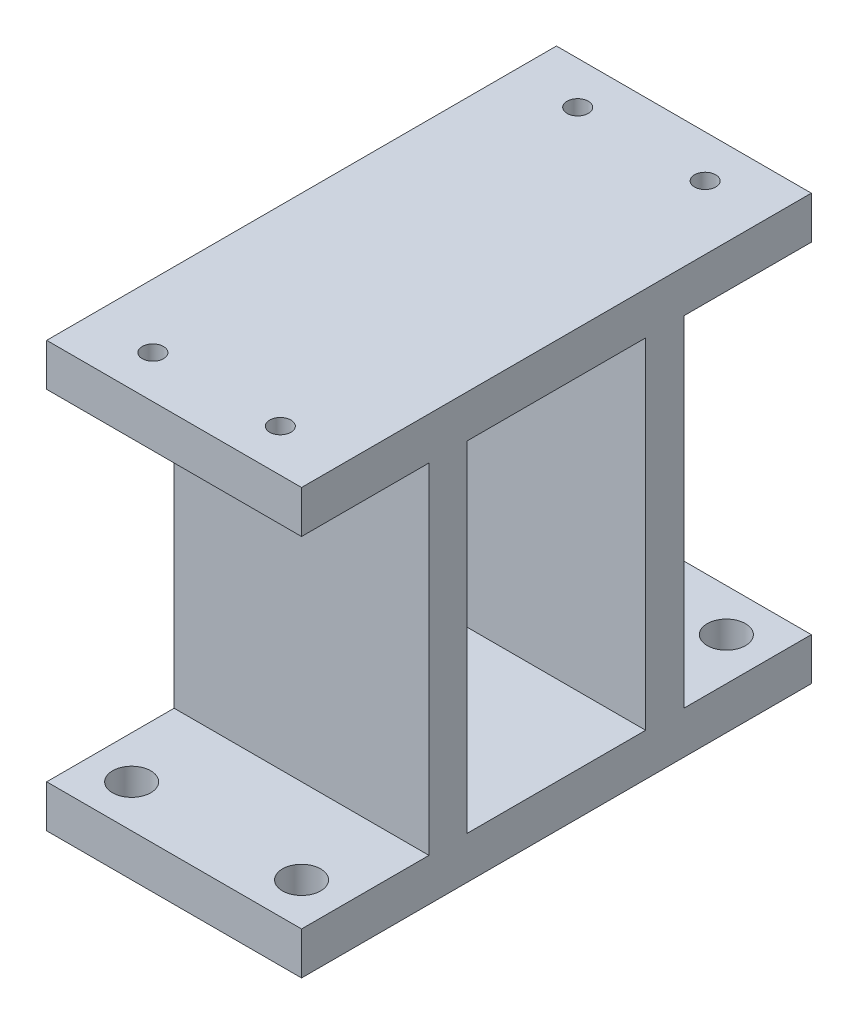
ISO-10303-21;
HEADER;
FILE_DESCRIPTION(('STEP AP214'),'2;1');
FILE_NAME('part.step','',(''),(''),'','','');
FILE_SCHEMA(('AUTOMOTIVE_DESIGN { 1 0 10303 214 1 1 1 1 }'));
ENDSEC;
DATA;
#1=APPLICATION_CONTEXT('core data for automotive mechanical design processes');
#2=APPLICATION_PROTOCOL_DEFINITION('international standard','automotive_design',2000,#1);
#3=PRODUCT_CONTEXT('',#1,'mechanical');
#4=PRODUCT('Part','Part','',(#3));
#5=PRODUCT_RELATED_PRODUCT_CATEGORY('part','',(#4));
#6=PRODUCT_DEFINITION_FORMATION('','',#4);
#7=PRODUCT_DEFINITION_CONTEXT('part definition',#1,'design');
#8=PRODUCT_DEFINITION('design','',#6,#7);
#9=PRODUCT_DEFINITION_SHAPE('','',#8);
#10=(LENGTH_UNIT() NAMED_UNIT(*) SI_UNIT(.MILLI.,.METRE.));
#11=(NAMED_UNIT(*) PLANE_ANGLE_UNIT() SI_UNIT($,.RADIAN.));
#12=(NAMED_UNIT(*) SI_UNIT($,.STERADIAN.) SOLID_ANGLE_UNIT());
#13=UNCERTAINTY_MEASURE_WITH_UNIT(LENGTH_MEASURE(1.E-05),#10,'distance_accuracy_value','');
#14=(GEOMETRIC_REPRESENTATION_CONTEXT(3) GLOBAL_UNCERTAINTY_ASSIGNED_CONTEXT((#13)) GLOBAL_UNIT_ASSIGNED_CONTEXT((#10,
#11,#12)) REPRESENTATION_CONTEXT('',''));
#15=CARTESIAN_POINT('',(0.,0.,0.));
#16=DIRECTION('',(0.,0.,1.));
#17=DIRECTION('',(1.,0.,0.));
#18=AXIS2_PLACEMENT_3D('',#15,#16,#17);
#19=CARTESIAN_POINT('',(0.,10.,0.));
#20=DIRECTION('',(0.,1.,0.));
#21=DIRECTION('',(0.,0.,1.));
#22=AXIS2_PLACEMENT_3D('',#19,#20,#21);
#23=PLANE('',#22);
#24=DIRECTION('',(0.,0.,-1.));
#25=VECTOR('',#24,1.);
#26=CARTESIAN_POINT('',(60.,10.,0.));
#27=LINE('',#26,#25);
#28=CARTESIAN_POINT('',(60.,10.,-39.));
#29=VERTEX_POINT('',#28);
#30=CARTESIAN_POINT('',(60.,10.,-81.));
#31=VERTEX_POINT('',#30);
#32=EDGE_CURVE('E266',#29,#31,#27,.T.);
#33=ORIENTED_EDGE('',*,*,#32,.T.);
#34=DIRECTION('',(1.,0.,0.));
#35=VECTOR('',#34,1.);
#36=CARTESIAN_POINT('',(0.,10.,-81.));
#37=LINE('',#36,#35);
#38=CARTESIAN_POINT('',(0.,10.,-81.));
#39=VERTEX_POINT('',#38);
#40=EDGE_CURVE('E53',#39,#31,#37,.T.);
#41=ORIENTED_EDGE('',*,*,#40,.F.);
#42=DIRECTION('',(0.,0.,1.));
#43=VECTOR('',#42,1.);
#44=CARTESIAN_POINT('',(0.,10.,-120.));
#45=LINE('',#44,#43);
#46=CARTESIAN_POINT('',(0.,10.,-39.));
#47=VERTEX_POINT('',#46);
#48=EDGE_CURVE('E260',#39,#47,#45,.T.);
#49=ORIENTED_EDGE('',*,*,#48,.T.);
#50=DIRECTION('',(-1.,0.,0.));
#51=VECTOR('',#50,1.);
#52=CARTESIAN_POINT('',(60.,10.,-39.));
#53=LINE('',#52,#51);
#54=EDGE_CURVE('E205',#29,#47,#53,.T.);
#55=ORIENTED_EDGE('',*,*,#54,.F.);
#56=EDGE_LOOP('',(#33,#41,#49,#55));
#57=FACE_BOUND('',#56,.T.);
#58=ADVANCED_FACE('F38',(#57),#23,.T.);
#59=CARTESIAN_POINT('',(10.,10.,-110.));
#60=DIRECTION('',(0.,1.,0.));
#61=DIRECTION('',(0.,0.,1.));
#62=AXIS2_PLACEMENT_3D('',#59,#60,#61);
#63=CIRCLE('',#62,4.5);
#64=CARTESIAN_POINT('',(10.,10.,-105.5));
#65=VERTEX_POINT('',#64);
#66=EDGE_CURVE('E230',#65,#65,#63,.T.);
#67=ORIENTED_EDGE('',*,*,#66,.F.);
#68=EDGE_LOOP('',(#67));
#69=FACE_BOUND('',#68,.T.);
#70=CARTESIAN_POINT('',(50.,10.,-110.));
#71=DIRECTION('',(0.,1.,0.));
#72=DIRECTION('',(0.,0.,1.));
#73=AXIS2_PLACEMENT_3D('',#70,#71,#72);
#74=CIRCLE('',#73,4.5);
#75=CARTESIAN_POINT('',(50.,10.,-105.5));
#76=VERTEX_POINT('',#75);
#77=EDGE_CURVE('E242',#76,#76,#74,.T.);
#78=ORIENTED_EDGE('',*,*,#77,.F.);
#79=EDGE_LOOP('',(#78));
#80=FACE_BOUND('',#79,.T.);
#81=CARTESIAN_POINT('',(0.,10.,-120.));
#82=VERTEX_POINT('',#81);
#83=CARTESIAN_POINT('',(0.,10.,-90.));
#84=VERTEX_POINT('',#83);
#85=EDGE_CURVE('E61',#82,#84,#45,.T.);
#86=ORIENTED_EDGE('',*,*,#85,.T.);
#87=DIRECTION('',(-1.,0.,0.));
#88=VECTOR('',#87,1.);
#89=CARTESIAN_POINT('',(60.,10.,-90.));
#90=LINE('',#89,#88);
#91=CARTESIAN_POINT('',(60.,10.,-90.));
#92=VERTEX_POINT('',#91);
#93=EDGE_CURVE('E180',#92,#84,#90,.T.);
#94=ORIENTED_EDGE('',*,*,#93,.F.);
#95=CARTESIAN_POINT('',(60.,10.,-120.));
#96=VERTEX_POINT('',#95);
#97=EDGE_CURVE('E262',#92,#96,#27,.T.);
#98=ORIENTED_EDGE('',*,*,#97,.T.);
#99=DIRECTION('',(-1.,0.,0.));
#100=VECTOR('',#99,1.);
#101=CARTESIAN_POINT('',(60.,10.,-120.));
#102=LINE('',#101,#100);
#103=EDGE_CURVE('E254',#96,#82,#102,.T.);
#104=ORIENTED_EDGE('',*,*,#103,.T.);
#105=EDGE_LOOP('',(#86,#94,#98,#104));
#106=FACE_BOUND('',#105,.T.);
#107=ADVANCED_FACE('F298',(#69,#80,#106),#23,.T.);
#108=DIRECTION('',(1.,0.,0.));
#109=VECTOR('',#108,1.);
#110=CARTESIAN_POINT('',(0.,10.,-30.));
#111=LINE('',#110,#109);
#112=CARTESIAN_POINT('',(0.,10.,-30.));
#113=VERTEX_POINT('',#112);
#114=CARTESIAN_POINT('',(60.,10.,-30.));
#115=VERTEX_POINT('',#114);
#116=EDGE_CURVE('E210',#113,#115,#111,.T.);
#117=ORIENTED_EDGE('',*,*,#116,.F.);
#118=CARTESIAN_POINT('',(0.,10.,0.));
#119=VERTEX_POINT('',#118);
#120=EDGE_CURVE('E256',#113,#119,#45,.T.);
#121=ORIENTED_EDGE('',*,*,#120,.T.);
#122=DIRECTION('',(1.,0.,0.));
#123=VECTOR('',#122,1.);
#124=CARTESIAN_POINT('',(0.,10.,0.));
#125=LINE('',#124,#123);
#126=CARTESIAN_POINT('',(60.,10.,0.));
#127=VERTEX_POINT('',#126);
#128=EDGE_CURVE('E259',#119,#127,#125,.T.);
#129=ORIENTED_EDGE('',*,*,#128,.T.);
#130=EDGE_CURVE('E263',#127,#115,#27,.T.);
#131=ORIENTED_EDGE('',*,*,#130,.T.);
#132=EDGE_LOOP('',(#117,#121,#129,#131));
#133=FACE_BOUND('',#132,.T.);
#134=CARTESIAN_POINT('',(10.,10.,-10.));
#135=DIRECTION('',(0.,1.,0.));
#136=DIRECTION('',(0.,0.,1.));
#137=AXIS2_PLACEMENT_3D('',#134,#135,#136);
#138=CIRCLE('',#137,4.5);
#139=CARTESIAN_POINT('',(10.,10.,-5.5));
#140=VERTEX_POINT('',#139);
#141=EDGE_CURVE('E236',#140,#140,#138,.T.);
#142=ORIENTED_EDGE('',*,*,#141,.F.);
#143=EDGE_LOOP('',(#142));
#144=FACE_BOUND('',#143,.T.);
#145=CARTESIAN_POINT('',(50.,10.,-10.));
#146=DIRECTION('',(0.,1.,0.));
#147=DIRECTION('',(0.,0.,1.));
#148=AXIS2_PLACEMENT_3D('',#145,#146,#147);
#149=CIRCLE('',#148,4.5);
#150=CARTESIAN_POINT('',(50.,10.,-5.5));
#151=VERTEX_POINT('',#150);
#152=EDGE_CURVE('E248',#151,#151,#149,.T.);
#153=ORIENTED_EDGE('',*,*,#152,.F.);
#154=EDGE_LOOP('',(#153));
#155=FACE_BOUND('',#154,.T.);
#156=ADVANCED_FACE('F331',(#133,#144,#155),#23,.T.);
#157=CARTESIAN_POINT('',(0.,0.,0.));
#158=DIRECTION('',(0.,1.,0.));
#159=DIRECTION('',(0.,0.,1.));
#160=AXIS2_PLACEMENT_3D('',#157,#158,#159);
#161=PLANE('',#160);
#162=DIRECTION('',(-1.,0.,0.));
#163=VECTOR('',#162,1.);
#164=CARTESIAN_POINT('',(60.,0.,-120.));
#165=LINE('',#164,#163);
#166=CARTESIAN_POINT('',(60.,0.,-120.));
#167=VERTEX_POINT('',#166);
#168=CARTESIAN_POINT('',(0.,0.,-120.));
#169=VERTEX_POINT('',#168);
#170=EDGE_CURVE('E251',#167,#169,#165,.T.);
#171=ORIENTED_EDGE('',*,*,#170,.F.);
#172=DIRECTION('',(0.,0.,-1.));
#173=VECTOR('',#172,1.);
#174=CARTESIAN_POINT('',(60.,0.,0.));
#175=LINE('',#174,#173);
#176=CARTESIAN_POINT('',(60.,0.,0.));
#177=VERTEX_POINT('',#176);
#178=EDGE_CURVE('E257',#177,#167,#175,.T.);
#179=ORIENTED_EDGE('',*,*,#178,.F.);
#180=DIRECTION('',(1.,0.,0.));
#181=VECTOR('',#180,1.);
#182=CARTESIAN_POINT('',(0.,0.,0.));
#183=LINE('',#182,#181);
#184=CARTESIAN_POINT('',(0.,0.,0.));
#185=VERTEX_POINT('',#184);
#186=EDGE_CURVE('E271',#185,#177,#183,.T.);
#187=ORIENTED_EDGE('',*,*,#186,.F.);
#188=DIRECTION('',(0.,0.,1.));
#189=VECTOR('',#188,1.);
#190=CARTESIAN_POINT('',(0.,0.,-120.));
#191=LINE('',#190,#189);
#192=EDGE_CURVE('E269',#169,#185,#191,.T.);
#193=ORIENTED_EDGE('',*,*,#192,.F.);
#194=EDGE_LOOP('',(#171,#179,#187,#193));
#195=FACE_BOUND('',#194,.T.);
#196=CARTESIAN_POINT('',(50.,0.,-10.));
#197=DIRECTION('',(0.,1.,0.));
#198=DIRECTION('',(0.,0.,1.));
#199=AXIS2_PLACEMENT_3D('',#196,#197,#198);
#200=CIRCLE('',#199,4.5);
#201=CARTESIAN_POINT('',(50.,0.,-5.5));
#202=VERTEX_POINT('',#201);
#203=EDGE_CURVE('E245',#202,#202,#200,.T.);
#204=ORIENTED_EDGE('',*,*,#203,.T.);
#205=EDGE_LOOP('',(#204));
#206=FACE_BOUND('',#205,.T.);
#207=CARTESIAN_POINT('',(50.,0.,-110.));
#208=DIRECTION('',(0.,1.,0.));
#209=DIRECTION('',(0.,0.,1.));
#210=AXIS2_PLACEMENT_3D('',#207,#208,#209);
#211=CIRCLE('',#210,4.5);
#212=CARTESIAN_POINT('',(50.,0.,-105.5));
#213=VERTEX_POINT('',#212);
#214=EDGE_CURVE('E239',#213,#213,#211,.T.);
#215=ORIENTED_EDGE('',*,*,#214,.T.);
#216=EDGE_LOOP('',(#215));
#217=FACE_BOUND('',#216,.T.);
#218=CARTESIAN_POINT('',(10.,0.,-10.));
#219=DIRECTION('',(0.,1.,0.));
#220=DIRECTION('',(0.,0.,1.));
#221=AXIS2_PLACEMENT_3D('',#218,#219,#220);
#222=CIRCLE('',#221,4.5);
#223=CARTESIAN_POINT('',(10.,0.,-5.5));
#224=VERTEX_POINT('',#223);
#225=EDGE_CURVE('E233',#224,#224,#222,.T.);
#226=ORIENTED_EDGE('',*,*,#225,.T.);
#227=EDGE_LOOP('',(#226));
#228=FACE_BOUND('',#227,.T.);
#229=CARTESIAN_POINT('',(10.,0.,-110.));
#230=DIRECTION('',(0.,1.,0.));
#231=DIRECTION('',(0.,0.,1.));
#232=AXIS2_PLACEMENT_3D('',#229,#230,#231);
#233=CIRCLE('',#232,4.5);
#234=CARTESIAN_POINT('',(10.,0.,-105.5));
#235=VERTEX_POINT('',#234);
#236=EDGE_CURVE('E229',#235,#235,#233,.T.);
#237=ORIENTED_EDGE('',*,*,#236,.T.);
#238=EDGE_LOOP('',(#237));
#239=FACE_BOUND('',#238,.T.);
#240=ADVANCED_FACE('F289',(#195,#206,#217,#228,#239),#161,.F.);
#241=CARTESIAN_POINT('',(60.,10.,-120.));
#242=DIRECTION('',(0.,0.,1.));
#243=DIRECTION('',(1.,0.,0.));
#244=AXIS2_PLACEMENT_3D('',#241,#242,#243);
#245=PLANE('',#244);
#246=ORIENTED_EDGE('',*,*,#170,.T.);
#247=DIRECTION('',(0.,-1.,0.));
#248=VECTOR('',#247,1.);
#249=CARTESIAN_POINT('',(0.,10.,-120.));
#250=LINE('',#249,#248);
#251=EDGE_CURVE('E11',#82,#169,#250,.T.);
#252=ORIENTED_EDGE('',*,*,#251,.F.);
#253=ORIENTED_EDGE('',*,*,#103,.F.);
#254=DIRECTION('',(0.,-1.,0.));
#255=VECTOR('',#254,1.);
#256=CARTESIAN_POINT('',(60.,10.,-120.));
#257=LINE('',#256,#255);
#258=EDGE_CURVE('E265',#96,#167,#257,.T.);
#259=ORIENTED_EDGE('',*,*,#258,.T.);
#260=EDGE_LOOP('',(#246,#252,#253,#259));
#261=FACE_BOUND('',#260,.T.);
#262=ADVANCED_FACE('F40',(#261),#245,.F.);
#263=CARTESIAN_POINT('',(0.,10.,-120.));
#264=DIRECTION('',(1.,0.,0.));
#265=DIRECTION('',(0.,0.,-1.));
#266=AXIS2_PLACEMENT_3D('',#263,#264,#265);
#267=PLANE('',#266);
#268=DIRECTION('',(0.,-1.,0.));
#269=VECTOR('',#268,1.);
#270=CARTESIAN_POINT('',(0.,90.,-30.));
#271=LINE('',#270,#269);
#272=CARTESIAN_POINT('',(0.,90.,-30.));
#273=VERTEX_POINT('',#272);
#274=EDGE_CURVE('E223',#273,#113,#271,.T.);
#275=ORIENTED_EDGE('',*,*,#274,.F.);
#276=DIRECTION('',(0.,0.,1.));
#277=VECTOR('',#276,1.);
#278=CARTESIAN_POINT('',(0.,90.,-120.));
#279=LINE('',#278,#277);
#280=CARTESIAN_POINT('',(0.,90.,0.));
#281=VERTEX_POINT('',#280);
#282=EDGE_CURVE('E327',#273,#281,#279,.T.);
#283=ORIENTED_EDGE('',*,*,#282,.T.);
#284=DIRECTION('',(0.,-1.,0.));
#285=VECTOR('',#284,1.);
#286=CARTESIAN_POINT('',(0.,100.,0.));
#287=LINE('',#286,#285);
#288=CARTESIAN_POINT('',(0.,100.,0.));
#289=VERTEX_POINT('',#288);
#290=EDGE_CURVE('E161',#289,#281,#287,.T.);
#291=ORIENTED_EDGE('',*,*,#290,.F.);
#292=DIRECTION('',(0.,0.,1.));
#293=VECTOR('',#292,1.);
#294=CARTESIAN_POINT('',(0.,100.,-120.));
#295=LINE('',#294,#293);
#296=CARTESIAN_POINT('',(0.,100.,-120.));
#297=VERTEX_POINT('',#296);
#298=EDGE_CURVE('E152',#297,#289,#295,.T.);
#299=ORIENTED_EDGE('',*,*,#298,.F.);
#300=DIRECTION('',(0.,-1.,0.));
#301=VECTOR('',#300,1.);
#302=CARTESIAN_POINT('',(0.,100.,-120.));
#303=LINE('',#302,#301);
#304=CARTESIAN_POINT('',(0.,90.,-120.));
#305=VERTEX_POINT('',#304);
#306=EDGE_CURVE('E158',#297,#305,#303,.T.);
#307=ORIENTED_EDGE('',*,*,#306,.T.);
#308=CARTESIAN_POINT('',(0.,90.,-90.));
#309=VERTEX_POINT('',#308);
#310=EDGE_CURVE('E339',#305,#309,#279,.T.);
#311=ORIENTED_EDGE('',*,*,#310,.T.);
#312=DIRECTION('',(0.,-1.,0.));
#313=VECTOR('',#312,1.);
#314=CARTESIAN_POINT('',(0.,90.,-90.));
#315=LINE('',#314,#313);
#316=EDGE_CURVE('E191',#309,#84,#315,.T.);
#317=ORIENTED_EDGE('',*,*,#316,.T.);
#318=ORIENTED_EDGE('',*,*,#85,.F.);
#319=ORIENTED_EDGE('',*,*,#251,.T.);
#320=ORIENTED_EDGE('',*,*,#192,.T.);
#321=DIRECTION('',(0.,-1.,0.));
#322=VECTOR('',#321,1.);
#323=CARTESIAN_POINT('',(0.,10.,0.));
#324=LINE('',#323,#322);
#325=EDGE_CURVE('E46',#119,#185,#324,.T.);
#326=ORIENTED_EDGE('',*,*,#325,.F.);
#327=ORIENTED_EDGE('',*,*,#120,.F.);
#328=EDGE_LOOP('',(#275,#283,#291,#299,#307,#311,#317,#318,#319,#320,#326,#327));
#329=FACE_BOUND('',#328,.T.);
#330=CARTESIAN_POINT('',(0.,90.,-81.));
#331=VERTEX_POINT('',#330);
#332=CARTESIAN_POINT('',(0.,90.,-39.));
#333=VERTEX_POINT('',#332);
#334=EDGE_CURVE('E335',#331,#333,#279,.T.);
#335=ORIENTED_EDGE('',*,*,#334,.T.);
#336=DIRECTION('',(0.,-1.,0.));
#337=VECTOR('',#336,1.);
#338=CARTESIAN_POINT('',(0.,90.,-39.));
#339=LINE('',#338,#337);
#340=EDGE_CURVE('E226',#333,#47,#339,.T.);
#341=ORIENTED_EDGE('',*,*,#340,.T.);
#342=ORIENTED_EDGE('',*,*,#48,.F.);
#343=DIRECTION('',(0.,-1.,0.));
#344=VECTOR('',#343,1.);
#345=CARTESIAN_POINT('',(0.,90.,-81.));
#346=LINE('',#345,#344);
#347=EDGE_CURVE('E202',#331,#39,#346,.T.);
#348=ORIENTED_EDGE('',*,*,#347,.F.);
#349=EDGE_LOOP('',(#335,#341,#342,#348));
#350=FACE_BOUND('',#349,.T.);
#351=ADVANCED_FACE('F154',(#329,#350),#267,.F.);
#352=CARTESIAN_POINT('',(0.,10.,0.));
#353=DIRECTION('',(0.,0.,-1.));
#354=DIRECTION('',(-1.,0.,0.));
#355=AXIS2_PLACEMENT_3D('',#352,#353,#354);
#356=PLANE('',#355);
#357=ORIENTED_EDGE('',*,*,#186,.T.);
#358=DIRECTION('',(0.,-1.,0.));
#359=VECTOR('',#358,1.);
#360=CARTESIAN_POINT('',(60.,10.,0.));
#361=LINE('',#360,#359);
#362=EDGE_CURVE('E276',#127,#177,#361,.T.);
#363=ORIENTED_EDGE('',*,*,#362,.F.);
#364=ORIENTED_EDGE('',*,*,#128,.F.);
#365=ORIENTED_EDGE('',*,*,#325,.T.);
#366=EDGE_LOOP('',(#357,#363,#364,#365));
#367=FACE_BOUND('',#366,.T.);
#368=ADVANCED_FACE('F283',(#367),#356,.F.);
#369=CARTESIAN_POINT('',(60.,10.,0.));
#370=DIRECTION('',(-1.,0.,0.));
#371=DIRECTION('',(0.,0.,1.));
#372=AXIS2_PLACEMENT_3D('',#369,#370,#371);
#373=PLANE('',#372);
#374=DIRECTION('',(0.,-1.,0.));
#375=VECTOR('',#374,1.);
#376=CARTESIAN_POINT('',(60.,90.,-39.));
#377=LINE('',#376,#375);
#378=CARTESIAN_POINT('',(60.,90.,-39.));
#379=VERTEX_POINT('',#378);
#380=EDGE_CURVE('E213',#379,#29,#377,.T.);
#381=ORIENTED_EDGE('',*,*,#380,.F.);
#382=DIRECTION('',(0.,0.,-1.));
#383=VECTOR('',#382,1.);
#384=CARTESIAN_POINT('',(60.,90.,0.));
#385=LINE('',#384,#383);
#386=CARTESIAN_POINT('',(60.,90.,-81.));
#387=VERTEX_POINT('',#386);
#388=EDGE_CURVE('E308',#379,#387,#385,.T.);
#389=ORIENTED_EDGE('',*,*,#388,.T.);
#390=DIRECTION('',(0.,-1.,0.));
#391=VECTOR('',#390,1.);
#392=CARTESIAN_POINT('',(60.,90.,-81.));
#393=LINE('',#392,#391);
#394=EDGE_CURVE('E199',#387,#31,#393,.T.);
#395=ORIENTED_EDGE('',*,*,#394,.T.);
#396=ORIENTED_EDGE('',*,*,#32,.F.);
#397=EDGE_LOOP('',(#381,#389,#395,#396));
#398=FACE_BOUND('',#397,.T.);
#399=ORIENTED_EDGE('',*,*,#178,.T.);
#400=ORIENTED_EDGE('',*,*,#258,.F.);
#401=ORIENTED_EDGE('',*,*,#97,.F.);
#402=DIRECTION('',(0.,-1.,0.));
#403=VECTOR('',#402,1.);
#404=CARTESIAN_POINT('',(60.,90.,-90.));
#405=LINE('',#404,#403);
#406=CARTESIAN_POINT('',(60.,90.,-90.));
#407=VERTEX_POINT('',#406);
#408=EDGE_CURVE('E196',#407,#92,#405,.T.);
#409=ORIENTED_EDGE('',*,*,#408,.F.);
#410=CARTESIAN_POINT('',(60.,90.,-120.));
#411=VERTEX_POINT('',#410);
#412=EDGE_CURVE('E310',#407,#411,#385,.T.);
#413=ORIENTED_EDGE('',*,*,#412,.T.);
#414=DIRECTION('',(0.,-1.,0.));
#415=VECTOR('',#414,1.);
#416=CARTESIAN_POINT('',(60.,100.,-120.));
#417=LINE('',#416,#415);
#418=CARTESIAN_POINT('',(60.,100.,-120.));
#419=VERTEX_POINT('',#418);
#420=EDGE_CURVE('E317',#419,#411,#417,.T.);
#421=ORIENTED_EDGE('',*,*,#420,.F.);
#422=DIRECTION('',(0.,0.,-1.));
#423=VECTOR('',#422,1.);
#424=CARTESIAN_POINT('',(60.,100.,0.));
#425=LINE('',#424,#423);
#426=CARTESIAN_POINT('',(60.,100.,0.));
#427=VERTEX_POINT('',#426);
#428=EDGE_CURVE('E170',#427,#419,#425,.T.);
#429=ORIENTED_EDGE('',*,*,#428,.F.);
#430=DIRECTION('',(0.,-1.,0.));
#431=VECTOR('',#430,1.);
#432=CARTESIAN_POINT('',(60.,100.,0.));
#433=LINE('',#432,#431);
#434=CARTESIAN_POINT('',(60.,90.,0.));
#435=VERTEX_POINT('',#434);
#436=EDGE_CURVE('E182',#427,#435,#433,.T.);
#437=ORIENTED_EDGE('',*,*,#436,.T.);
#438=CARTESIAN_POINT('',(60.,90.,-30.));
#439=VERTEX_POINT('',#438);
#440=EDGE_CURVE('E174',#435,#439,#385,.T.);
#441=ORIENTED_EDGE('',*,*,#440,.T.);
#442=DIRECTION('',(0.,-1.,0.));
#443=VECTOR('',#442,1.);
#444=CARTESIAN_POINT('',(60.,90.,-30.));
#445=LINE('',#444,#443);
#446=EDGE_CURVE('E220',#439,#115,#445,.T.);
#447=ORIENTED_EDGE('',*,*,#446,.T.);
#448=ORIENTED_EDGE('',*,*,#130,.F.);
#449=ORIENTED_EDGE('',*,*,#362,.T.);
#450=EDGE_LOOP('',(#399,#400,#401,#409,#413,#421,#429,#437,#441,#447,#448,#449));
#451=FACE_BOUND('',#450,.T.);
#452=ADVANCED_FACE('F293',(#398,#451),#373,.F.);
#453=CARTESIAN_POINT('',(50.,10.,-10.));
#454=DIRECTION('',(0.,-1.,0.));
#455=DIRECTION('',(0.,0.,-1.));
#456=AXIS2_PLACEMENT_3D('',#453,#454,#455);
#457=CYLINDRICAL_SURFACE('',#456,4.5);
#458=ORIENTED_EDGE('',*,*,#152,.T.);
#459=EDGE_LOOP('',(#458));
#460=FACE_BOUND('',#459,.T.);
#461=ORIENTED_EDGE('',*,*,#203,.F.);
#462=EDGE_LOOP('',(#461));
#463=FACE_BOUND('',#462,.T.);
#464=ADVANCED_FACE('F411',(#460,#463),#457,.F.);
#465=CARTESIAN_POINT('',(50.,10.,-110.));
#466=DIRECTION('',(0.,-1.,0.));
#467=DIRECTION('',(0.,0.,-1.));
#468=AXIS2_PLACEMENT_3D('',#465,#466,#467);
#469=CYLINDRICAL_SURFACE('',#468,4.5);
#470=ORIENTED_EDGE('',*,*,#77,.T.);
#471=EDGE_LOOP('',(#470));
#472=FACE_BOUND('',#471,.T.);
#473=ORIENTED_EDGE('',*,*,#214,.F.);
#474=EDGE_LOOP('',(#473));
#475=FACE_BOUND('',#474,.T.);
#476=ADVANCED_FACE('F434',(#472,#475),#469,.F.);
#477=CARTESIAN_POINT('',(10.,10.,-10.));
#478=DIRECTION('',(0.,-1.,0.));
#479=DIRECTION('',(0.,0.,-1.));
#480=AXIS2_PLACEMENT_3D('',#477,#478,#479);
#481=CYLINDRICAL_SURFACE('',#480,4.5);
#482=ORIENTED_EDGE('',*,*,#141,.T.);
#483=EDGE_LOOP('',(#482));
#484=FACE_BOUND('',#483,.T.);
#485=ORIENTED_EDGE('',*,*,#225,.F.);
#486=EDGE_LOOP('',(#485));
#487=FACE_BOUND('',#486,.T.);
#488=ADVANCED_FACE('F441',(#484,#487),#481,.F.);
#489=CARTESIAN_POINT('',(10.,10.,-110.));
#490=DIRECTION('',(0.,-1.,0.));
#491=DIRECTION('',(0.,0.,-1.));
#492=AXIS2_PLACEMENT_3D('',#489,#490,#491);
#493=CYLINDRICAL_SURFACE('',#492,4.5);
#494=ORIENTED_EDGE('',*,*,#66,.T.);
#495=EDGE_LOOP('',(#494));
#496=FACE_BOUND('',#495,.T.);
#497=ORIENTED_EDGE('',*,*,#236,.F.);
#498=EDGE_LOOP('',(#497));
#499=FACE_BOUND('',#498,.T.);
#500=ADVANCED_FACE('F449',(#496,#499),#493,.F.);
#501=CARTESIAN_POINT('',(60.,90.,-39.));
#502=DIRECTION('',(0.,0.,1.));
#503=DIRECTION('',(1.,0.,0.));
#504=AXIS2_PLACEMENT_3D('',#501,#502,#503);
#505=PLANE('',#504);
#506=ORIENTED_EDGE('',*,*,#54,.T.);
#507=ORIENTED_EDGE('',*,*,#340,.F.);
#508=DIRECTION('',(-1.,0.,0.));
#509=VECTOR('',#508,1.);
#510=CARTESIAN_POINT('',(60.,90.,-39.));
#511=LINE('',#510,#509);
#512=EDGE_CURVE('E206',#379,#333,#511,.T.);
#513=ORIENTED_EDGE('',*,*,#512,.F.);
#514=ORIENTED_EDGE('',*,*,#380,.T.);
#515=EDGE_LOOP('',(#506,#507,#513,#514));
#516=FACE_BOUND('',#515,.T.);
#517=ADVANCED_FACE('F337',(#516),#505,.F.);
#518=CARTESIAN_POINT('',(0.,90.,-30.));
#519=DIRECTION('',(0.,0.,-1.));
#520=DIRECTION('',(-1.,0.,0.));
#521=AXIS2_PLACEMENT_3D('',#518,#519,#520);
#522=PLANE('',#521);
#523=ORIENTED_EDGE('',*,*,#116,.T.);
#524=ORIENTED_EDGE('',*,*,#446,.F.);
#525=DIRECTION('',(1.,0.,0.));
#526=VECTOR('',#525,1.);
#527=CARTESIAN_POINT('',(0.,90.,-30.));
#528=LINE('',#527,#526);
#529=EDGE_CURVE('E209',#273,#439,#528,.T.);
#530=ORIENTED_EDGE('',*,*,#529,.F.);
#531=ORIENTED_EDGE('',*,*,#274,.T.);
#532=EDGE_LOOP('',(#523,#524,#530,#531));
#533=FACE_BOUND('',#532,.T.);
#534=ADVANCED_FACE('F329',(#533),#522,.F.);
#535=CARTESIAN_POINT('',(0.,90.,-81.));
#536=DIRECTION('',(0.,0.,-1.));
#537=DIRECTION('',(-1.,0.,0.));
#538=AXIS2_PLACEMENT_3D('',#535,#536,#537);
#539=PLANE('',#538);
#540=ORIENTED_EDGE('',*,*,#40,.T.);
#541=ORIENTED_EDGE('',*,*,#394,.F.);
#542=DIRECTION('',(1.,0.,0.));
#543=VECTOR('',#542,1.);
#544=CARTESIAN_POINT('',(0.,90.,-81.));
#545=LINE('',#544,#543);
#546=EDGE_CURVE('E186',#331,#387,#545,.T.);
#547=ORIENTED_EDGE('',*,*,#546,.F.);
#548=ORIENTED_EDGE('',*,*,#347,.T.);
#549=EDGE_LOOP('',(#540,#541,#547,#548));
#550=FACE_BOUND('',#549,.T.);
#551=ADVANCED_FACE('F304',(#550),#539,.F.);
#552=CARTESIAN_POINT('',(60.,90.,-90.));
#553=DIRECTION('',(0.,0.,1.));
#554=DIRECTION('',(1.,0.,0.));
#555=AXIS2_PLACEMENT_3D('',#552,#553,#554);
#556=PLANE('',#555);
#557=ORIENTED_EDGE('',*,*,#93,.T.);
#558=ORIENTED_EDGE('',*,*,#316,.F.);
#559=DIRECTION('',(-1.,0.,0.));
#560=VECTOR('',#559,1.);
#561=CARTESIAN_POINT('',(60.,90.,-90.));
#562=LINE('',#561,#560);
#563=EDGE_CURVE('E189',#407,#309,#562,.T.);
#564=ORIENTED_EDGE('',*,*,#563,.F.);
#565=ORIENTED_EDGE('',*,*,#408,.T.);
#566=EDGE_LOOP('',(#557,#558,#564,#565));
#567=FACE_BOUND('',#566,.T.);
#568=ADVANCED_FACE('F475',(#567),#556,.F.);
#569=CARTESIAN_POINT('',(0.,90.,0.));
#570=DIRECTION('',(0.,1.,0.));
#571=DIRECTION('',(0.,0.,1.));
#572=AXIS2_PLACEMENT_3D('',#569,#570,#571);
#573=PLANE('',#572);
#574=ORIENTED_EDGE('',*,*,#388,.F.);
#575=ORIENTED_EDGE('',*,*,#512,.T.);
#576=ORIENTED_EDGE('',*,*,#334,.F.);
#577=ORIENTED_EDGE('',*,*,#546,.T.);
#578=EDGE_LOOP('',(#574,#575,#576,#577));
#579=FACE_BOUND('',#578,.T.);
#580=ADVANCED_FACE('F338',(#579),#573,.F.);
#581=CARTESIAN_POINT('',(15.,90.,-9.99999999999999));
#582=DIRECTION('',(0.,1.,0.));
#583=DIRECTION('',(0.,0.,1.));
#584=AXIS2_PLACEMENT_3D('',#581,#582,#583);
#585=CIRCLE('',#584,2.49999999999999);
#586=CARTESIAN_POINT('',(15.,90.,-7.5));
#587=VERTEX_POINT('',#586);
#588=EDGE_CURVE('E362',#587,#587,#585,.T.);
#589=ORIENTED_EDGE('',*,*,#588,.T.);
#590=EDGE_LOOP('',(#589));
#591=FACE_BOUND('',#590,.T.);
#592=CARTESIAN_POINT('',(45.,90.,-10.));
#593=DIRECTION('',(0.,1.,0.));
#594=DIRECTION('',(0.,0.,1.));
#595=AXIS2_PLACEMENT_3D('',#592,#593,#594);
#596=CIRCLE('',#595,2.49999999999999);
#597=CARTESIAN_POINT('',(45.,90.,-7.50000000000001));
#598=VERTEX_POINT('',#597);
#599=EDGE_CURVE('E356',#598,#598,#596,.T.);
#600=ORIENTED_EDGE('',*,*,#599,.T.);
#601=EDGE_LOOP('',(#600));
#602=FACE_BOUND('',#601,.T.);
#603=ORIENTED_EDGE('',*,*,#282,.F.);
#604=ORIENTED_EDGE('',*,*,#529,.T.);
#605=ORIENTED_EDGE('',*,*,#440,.F.);
#606=DIRECTION('',(1.,0.,0.));
#607=VECTOR('',#606,1.);
#608=CARTESIAN_POINT('',(0.,90.,0.));
#609=LINE('',#608,#607);
#610=EDGE_CURVE('E313',#281,#435,#609,.T.);
#611=ORIENTED_EDGE('',*,*,#610,.F.);
#612=EDGE_LOOP('',(#603,#604,#605,#611));
#613=FACE_BOUND('',#612,.T.);
#614=ADVANCED_FACE('F325',(#591,#602,#613),#573,.F.);
#615=CARTESIAN_POINT('',(45.,90.,-110.));
#616=DIRECTION('',(0.,1.,0.));
#617=DIRECTION('',(0.,0.,1.));
#618=AXIS2_PLACEMENT_3D('',#615,#616,#617);
#619=CIRCLE('',#618,2.49999999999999);
#620=CARTESIAN_POINT('',(45.,90.,-107.5));
#621=VERTEX_POINT('',#620);
#622=EDGE_CURVE('E350',#621,#621,#619,.T.);
#623=ORIENTED_EDGE('',*,*,#622,.T.);
#624=EDGE_LOOP('',(#623));
#625=FACE_BOUND('',#624,.T.);
#626=CARTESIAN_POINT('',(15.,90.,-110.));
#627=DIRECTION('',(0.,1.,0.));
#628=DIRECTION('',(0.,0.,1.));
#629=AXIS2_PLACEMENT_3D('',#626,#627,#628);
#630=CIRCLE('',#629,2.49999999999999);
#631=CARTESIAN_POINT('',(15.,90.,-107.5));
#632=VERTEX_POINT('',#631);
#633=EDGE_CURVE('E342',#632,#632,#630,.T.);
#634=ORIENTED_EDGE('',*,*,#633,.T.);
#635=EDGE_LOOP('',(#634));
#636=FACE_BOUND('',#635,.T.);
#637=ORIENTED_EDGE('',*,*,#412,.F.);
#638=ORIENTED_EDGE('',*,*,#563,.T.);
#639=ORIENTED_EDGE('',*,*,#310,.F.);
#640=DIRECTION('',(-1.,0.,0.));
#641=VECTOR('',#640,1.);
#642=CARTESIAN_POINT('',(60.,90.,-120.));
#643=LINE('',#642,#641);
#644=EDGE_CURVE('E178',#411,#305,#643,.T.);
#645=ORIENTED_EDGE('',*,*,#644,.F.);
#646=EDGE_LOOP('',(#637,#638,#639,#645));
#647=FACE_BOUND('',#646,.T.);
#648=ADVANCED_FACE('F490',(#625,#636,#647),#573,.F.);
#649=CARTESIAN_POINT('',(60.,100.,-120.));
#650=DIRECTION('',(0.,0.,1.));
#651=DIRECTION('',(1.,0.,0.));
#652=AXIS2_PLACEMENT_3D('',#649,#650,#651);
#653=PLANE('',#652);
#654=ORIENTED_EDGE('',*,*,#644,.T.);
#655=ORIENTED_EDGE('',*,*,#306,.F.);
#656=DIRECTION('',(-1.,0.,0.));
#657=VECTOR('',#656,1.);
#658=CARTESIAN_POINT('',(60.,100.,-120.));
#659=LINE('',#658,#657);
#660=EDGE_CURVE('E165',#419,#297,#659,.T.);
#661=ORIENTED_EDGE('',*,*,#660,.F.);
#662=ORIENTED_EDGE('',*,*,#420,.T.);
#663=EDGE_LOOP('',(#654,#655,#661,#662));
#664=FACE_BOUND('',#663,.T.);
#665=ADVANCED_FACE('F176',(#664),#653,.F.);
#666=CARTESIAN_POINT('',(0.,100.,0.));
#667=DIRECTION('',(0.,0.,-1.));
#668=DIRECTION('',(-1.,0.,0.));
#669=AXIS2_PLACEMENT_3D('',#666,#667,#668);
#670=PLANE('',#669);
#671=ORIENTED_EDGE('',*,*,#610,.T.);
#672=ORIENTED_EDGE('',*,*,#436,.F.);
#673=DIRECTION('',(1.,0.,0.));
#674=VECTOR('',#673,1.);
#675=CARTESIAN_POINT('',(0.,100.,0.));
#676=LINE('',#675,#674);
#677=EDGE_CURVE('E164',#289,#427,#676,.T.);
#678=ORIENTED_EDGE('',*,*,#677,.F.);
#679=ORIENTED_EDGE('',*,*,#290,.T.);
#680=EDGE_LOOP('',(#671,#672,#678,#679));
#681=FACE_BOUND('',#680,.T.);
#682=ADVANCED_FACE('F374',(#681),#670,.F.);
#683=CARTESIAN_POINT('',(0.,100.,0.));
#684=DIRECTION('',(0.,1.,0.));
#685=DIRECTION('',(0.,0.,1.));
#686=AXIS2_PLACEMENT_3D('',#683,#684,#685);
#687=PLANE('',#686);
#688=CARTESIAN_POINT('',(15.,100.,-9.99999999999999));
#689=DIRECTION('',(0.,1.,0.));
#690=DIRECTION('',(0.,0.,1.));
#691=AXIS2_PLACEMENT_3D('',#688,#689,#690);
#692=CIRCLE('',#691,2.49999999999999);
#693=CARTESIAN_POINT('',(15.,100.,-7.50000000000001));
#694=VERTEX_POINT('',#693);
#695=EDGE_CURVE('E365',#694,#694,#692,.T.);
#696=ORIENTED_EDGE('',*,*,#695,.F.);
#697=EDGE_LOOP('',(#696));
#698=FACE_BOUND('',#697,.T.);
#699=CARTESIAN_POINT('',(45.,100.,-10.));
#700=DIRECTION('',(0.,1.,0.));
#701=DIRECTION('',(0.,0.,1.));
#702=AXIS2_PLACEMENT_3D('',#699,#700,#701);
#703=CIRCLE('',#702,2.49999999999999);
#704=CARTESIAN_POINT('',(45.,100.,-7.50000000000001));
#705=VERTEX_POINT('',#704);
#706=EDGE_CURVE('E359',#705,#705,#703,.T.);
#707=ORIENTED_EDGE('',*,*,#706,.F.);
#708=EDGE_LOOP('',(#707));
#709=FACE_BOUND('',#708,.T.);
#710=CARTESIAN_POINT('',(45.,100.,-110.));
#711=DIRECTION('',(0.,1.,0.));
#712=DIRECTION('',(0.,0.,1.));
#713=AXIS2_PLACEMENT_3D('',#710,#711,#712);
#714=CIRCLE('',#713,2.49999999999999);
#715=CARTESIAN_POINT('',(45.,100.,-107.5));
#716=VERTEX_POINT('',#715);
#717=EDGE_CURVE('E353',#716,#716,#714,.T.);
#718=ORIENTED_EDGE('',*,*,#717,.F.);
#719=EDGE_LOOP('',(#718));
#720=FACE_BOUND('',#719,.T.);
#721=CARTESIAN_POINT('',(15.,100.,-110.));
#722=DIRECTION('',(0.,1.,0.));
#723=DIRECTION('',(0.,0.,1.));
#724=AXIS2_PLACEMENT_3D('',#721,#722,#723);
#725=CIRCLE('',#724,2.49999999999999);
#726=CARTESIAN_POINT('',(15.,100.,-107.5));
#727=VERTEX_POINT('',#726);
#728=EDGE_CURVE('E347',#727,#727,#725,.T.);
#729=ORIENTED_EDGE('',*,*,#728,.F.);
#730=EDGE_LOOP('',(#729));
#731=FACE_BOUND('',#730,.T.);
#732=ORIENTED_EDGE('',*,*,#660,.T.);
#733=ORIENTED_EDGE('',*,*,#298,.T.);
#734=ORIENTED_EDGE('',*,*,#677,.T.);
#735=ORIENTED_EDGE('',*,*,#428,.T.);
#736=EDGE_LOOP('',(#732,#733,#734,#735));
#737=FACE_BOUND('',#736,.T.);
#738=ADVANCED_FACE('F168',(#698,#709,#720,#731,#737),#687,.T.);
#739=CARTESIAN_POINT('',(15.,100.,-110.));
#740=DIRECTION('',(0.,1.,0.));
#741=DIRECTION('',(0.,0.,1.));
#742=AXIS2_PLACEMENT_3D('',#739,#740,#741);
#743=CYLINDRICAL_SURFACE('',#742,2.49999999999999);
#744=ORIENTED_EDGE('',*,*,#633,.F.);
#745=EDGE_LOOP('',(#744));
#746=FACE_BOUND('',#745,.T.);
#747=ORIENTED_EDGE('',*,*,#728,.T.);
#748=EDGE_LOOP('',(#747));
#749=FACE_BOUND('',#748,.T.);
#750=ADVANCED_FACE('F373',(#746,#749),#743,.F.);
#751=CARTESIAN_POINT('',(45.,100.,-110.));
#752=DIRECTION('',(0.,1.,0.));
#753=DIRECTION('',(0.,0.,1.));
#754=AXIS2_PLACEMENT_3D('',#751,#752,#753);
#755=CYLINDRICAL_SURFACE('',#754,2.49999999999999);
#756=ORIENTED_EDGE('',*,*,#622,.F.);
#757=EDGE_LOOP('',(#756));
#758=FACE_BOUND('',#757,.T.);
#759=ORIENTED_EDGE('',*,*,#717,.T.);
#760=EDGE_LOOP('',(#759));
#761=FACE_BOUND('',#760,.T.);
#762=ADVANCED_FACE('F383',(#758,#761),#755,.F.);
#763=CARTESIAN_POINT('',(45.,100.,-10.));
#764=DIRECTION('',(0.,1.,0.));
#765=DIRECTION('',(0.,0.,1.));
#766=AXIS2_PLACEMENT_3D('',#763,#764,#765);
#767=CYLINDRICAL_SURFACE('',#766,2.49999999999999);
#768=ORIENTED_EDGE('',*,*,#599,.F.);
#769=EDGE_LOOP('',(#768));
#770=FACE_BOUND('',#769,.T.);
#771=ORIENTED_EDGE('',*,*,#706,.T.);
#772=EDGE_LOOP('',(#771));
#773=FACE_BOUND('',#772,.T.);
#774=ADVANCED_FACE('F389',(#770,#773),#767,.F.);
#775=CARTESIAN_POINT('',(15.,100.,-9.99999999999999));
#776=DIRECTION('',(0.,1.,0.));
#777=DIRECTION('',(0.,0.,1.));
#778=AXIS2_PLACEMENT_3D('',#775,#776,#777);
#779=CYLINDRICAL_SURFACE('',#778,2.49999999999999);
#780=ORIENTED_EDGE('',*,*,#588,.F.);
#781=EDGE_LOOP('',(#780));
#782=FACE_BOUND('',#781,.T.);
#783=ORIENTED_EDGE('',*,*,#695,.T.);
#784=EDGE_LOOP('',(#783));
#785=FACE_BOUND('',#784,.T.);
#786=ADVANCED_FACE('F369',(#782,#785),#779,.F.);
#787=CLOSED_SHELL('',(#58,#107,#156,#240,#262,#351,#368,#452,#464,#476,#488,#500,#517,#534,#551,
#568,#580,#614,#648,#665,#682,#738,#750,#762,#774,#786));
#788=MANIFOLD_SOLID_BREP('B2',#787);
#789=ADVANCED_BREP_SHAPE_REPRESENTATION('',(#18,#788),#14);
#790=SHAPE_DEFINITION_REPRESENTATION(#9,#789);
ENDSEC;
END-ISO-10303-21;
